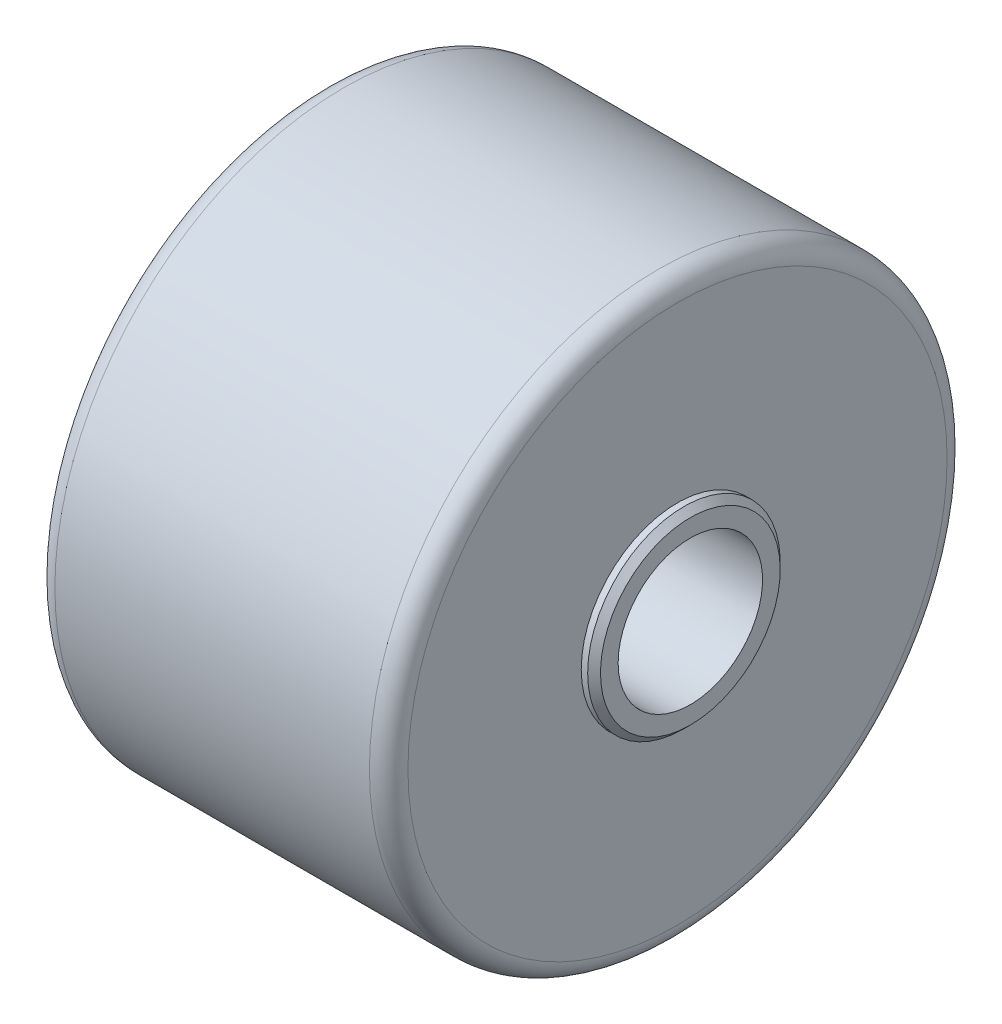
ISO-10303-21;
HEADER;
FILE_DESCRIPTION(('STEP AP214'),'2;1');
FILE_NAME('part.step','',(''),(''),'','','');
FILE_SCHEMA(('AUTOMOTIVE_DESIGN { 1 0 10303 214 1 1 1 1 }'));
ENDSEC;
DATA;
#1=APPLICATION_CONTEXT('core data for automotive mechanical design processes');
#2=APPLICATION_PROTOCOL_DEFINITION('international standard','automotive_design',2000,#1);
#3=PRODUCT_CONTEXT('',#1,'mechanical');
#4=PRODUCT('Part','Part','',(#3));
#5=PRODUCT_RELATED_PRODUCT_CATEGORY('part','',(#4));
#6=PRODUCT_DEFINITION_FORMATION('','',#4);
#7=PRODUCT_DEFINITION_CONTEXT('part definition',#1,'design');
#8=PRODUCT_DEFINITION('design','',#6,#7);
#9=PRODUCT_DEFINITION_SHAPE('','',#8);
#10=(LENGTH_UNIT() NAMED_UNIT(*) SI_UNIT(.MILLI.,.METRE.));
#11=(NAMED_UNIT(*) PLANE_ANGLE_UNIT() SI_UNIT($,.RADIAN.));
#12=(NAMED_UNIT(*) SI_UNIT($,.STERADIAN.) SOLID_ANGLE_UNIT());
#13=UNCERTAINTY_MEASURE_WITH_UNIT(LENGTH_MEASURE(1.E-05),#10,'distance_accuracy_value','');
#14=(GEOMETRIC_REPRESENTATION_CONTEXT(3) GLOBAL_UNCERTAINTY_ASSIGNED_CONTEXT((#13)) GLOBAL_UNIT_ASSIGNED_CONTEXT((#10,
#11,#12)) REPRESENTATION_CONTEXT('',''));
#15=CARTESIAN_POINT('',(0.,0.,0.));
#16=DIRECTION('',(0.,0.,1.));
#17=DIRECTION('',(1.,0.,0.));
#18=AXIS2_PLACEMENT_3D('',#15,#16,#17);
#19=CARTESIAN_POINT('',(50.,0.,0.));
#20=DIRECTION('',(-1.,0.,0.));
#21=DIRECTION('',(0.,0.,1.));
#22=AXIS2_PLACEMENT_3D('',#19,#20,#21);
#23=CYLINDRICAL_SURFACE('',#22,11.25);
#24=CARTESIAN_POINT('',(-29.5,0.,0.));
#25=DIRECTION('',(-1.,0.,0.));
#26=DIRECTION('',(0.,0.,1.));
#27=AXIS2_PLACEMENT_3D('',#24,#25,#26);
#28=CIRCLE('',#27,11.25);
#29=CARTESIAN_POINT('',(-29.5,0.,11.25));
#30=VERTEX_POINT('',#29);
#31=EDGE_CURVE('E17',#30,#30,#28,.F.);
#32=ORIENTED_EDGE('',*,*,#31,.F.);
#33=EDGE_LOOP('',(#32));
#34=FACE_BOUND('',#33,.T.);
#35=CARTESIAN_POINT('',(29.5,0.,0.));
#36=DIRECTION('',(-1.,0.,0.));
#37=DIRECTION('',(0.,0.,1.));
#38=AXIS2_PLACEMENT_3D('',#35,#36,#37);
#39=CIRCLE('',#38,11.25);
#40=CARTESIAN_POINT('',(29.5,0.,11.25));
#41=VERTEX_POINT('',#40);
#42=EDGE_CURVE('E139',#41,#41,#39,.T.);
#43=ORIENTED_EDGE('',*,*,#42,.F.);
#44=EDGE_LOOP('',(#43));
#45=FACE_BOUND('',#44,.T.);
#46=ADVANCED_FACE('F14',(#34,#45),#23,.F.);
#47=CARTESIAN_POINT('',(-29.5,14.,0.));
#48=DIRECTION('',(-1.,0.,0.));
#49=DIRECTION('',(0.,0.,1.));
#50=AXIS2_PLACEMENT_3D('',#47,#48,#49);
#51=PLANE('',#50);
#52=CARTESIAN_POINT('',(-29.5,0.,0.));
#53=DIRECTION('',(1.,0.,0.));
#54=DIRECTION('',(0.,1.,0.));
#55=AXIS2_PLACEMENT_3D('',#52,#53,#54);
#56=CIRCLE('',#55,14.);
#57=CARTESIAN_POINT('',(-29.5,14.,0.));
#58=VERTEX_POINT('',#57);
#59=EDGE_CURVE('E137',#58,#58,#56,.T.);
#60=ORIENTED_EDGE('',*,*,#59,.F.);
#61=EDGE_LOOP('',(#60));
#62=FACE_BOUND('',#61,.T.);
#63=ORIENTED_EDGE('',*,*,#31,.T.);
#64=EDGE_LOOP('',(#63));
#65=FACE_BOUND('',#64,.T.);
#66=ADVANCED_FACE('F99',(#62,#65),#51,.T.);
#67=CARTESIAN_POINT('',(29.5,11.25,0.));
#68=DIRECTION('',(1.,0.,0.));
#69=DIRECTION('',(0.,0.,-1.));
#70=AXIS2_PLACEMENT_3D('',#67,#68,#69);
#71=PLANE('',#70);
#72=ORIENTED_EDGE('',*,*,#42,.T.);
#73=EDGE_LOOP('',(#72));
#74=FACE_BOUND('',#73,.T.);
#75=CARTESIAN_POINT('',(29.5,0.,0.));
#76=DIRECTION('',(-1.,0.,0.));
#77=DIRECTION('',(0.,-1.,0.));
#78=AXIS2_PLACEMENT_3D('',#75,#76,#77);
#79=CIRCLE('',#78,14.);
#80=CARTESIAN_POINT('',(29.5,-14.,0.));
#81=VERTEX_POINT('',#80);
#82=EDGE_CURVE('E133',#81,#81,#79,.T.);
#83=ORIENTED_EDGE('',*,*,#82,.F.);
#84=EDGE_LOOP('',(#83));
#85=FACE_BOUND('',#84,.T.);
#86=ADVANCED_FACE('F96',(#74,#85),#71,.T.);
#87=CARTESIAN_POINT('',(-28.5,0.,0.));
#88=DIRECTION('',(1.,0.,0.));
#89=DIRECTION('',(0.,1.,0.));
#90=AXIS2_PLACEMENT_3D('',#87,#88,#89);
#91=CONICAL_SURFACE('',#90,15.,0.785398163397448);
#92=CARTESIAN_POINT('',(-28.5,0.,0.));
#93=DIRECTION('',(-1.,0.,0.));
#94=DIRECTION('',(0.,0.,1.));
#95=AXIS2_PLACEMENT_3D('',#92,#93,#94);
#96=CIRCLE('',#95,15.);
#97=CARTESIAN_POINT('',(-28.5,0.,15.));
#98=VERTEX_POINT('',#97);
#99=EDGE_CURVE('E136',#98,#98,#96,.F.);
#100=ORIENTED_EDGE('',*,*,#99,.F.);
#101=EDGE_LOOP('',(#100));
#102=FACE_BOUND('',#101,.T.);
#103=ORIENTED_EDGE('',*,*,#59,.T.);
#104=EDGE_LOOP('',(#103));
#105=FACE_BOUND('',#104,.T.);
#106=ADVANCED_FACE('F92',(#102,#105),#91,.T.);
#107=CARTESIAN_POINT('',(28.5,0.,0.));
#108=DIRECTION('',(-1.,0.,0.));
#109=DIRECTION('',(0.,-1.,0.));
#110=AXIS2_PLACEMENT_3D('',#107,#108,#109);
#111=CONICAL_SURFACE('',#110,15.,0.785398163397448);
#112=ORIENTED_EDGE('',*,*,#82,.T.);
#113=EDGE_LOOP('',(#112));
#114=FACE_BOUND('',#113,.T.);
#115=CARTESIAN_POINT('',(28.5,0.,0.));
#116=DIRECTION('',(-1.,0.,0.));
#117=DIRECTION('',(0.,0.,1.));
#118=AXIS2_PLACEMENT_3D('',#115,#116,#117);
#119=CIRCLE('',#118,15.);
#120=CARTESIAN_POINT('',(28.5,0.,15.));
#121=VERTEX_POINT('',#120);
#122=EDGE_CURVE('E127',#121,#121,#119,.T.);
#123=ORIENTED_EDGE('',*,*,#122,.F.);
#124=EDGE_LOOP('',(#123));
#125=FACE_BOUND('',#124,.T.);
#126=ADVANCED_FACE('F88',(#114,#125),#111,.T.);
#127=CARTESIAN_POINT('',(50.,0.,0.));
#128=DIRECTION('',(-1.,0.,0.));
#129=DIRECTION('',(0.,0.,1.));
#130=AXIS2_PLACEMENT_3D('',#127,#128,#129);
#131=CYLINDRICAL_SURFACE('',#130,15.);
#132=CARTESIAN_POINT('',(-27.5,0.,0.));
#133=DIRECTION('',(-1.,0.,0.));
#134=DIRECTION('',(0.,0.,1.));
#135=AXIS2_PLACEMENT_3D('',#132,#133,#134);
#136=CIRCLE('',#135,15.);
#137=CARTESIAN_POINT('',(-27.5,0.,15.));
#138=VERTEX_POINT('',#137);
#139=EDGE_CURVE('E122',#138,#138,#136,.F.);
#140=ORIENTED_EDGE('',*,*,#139,.F.);
#141=EDGE_LOOP('',(#140));
#142=FACE_BOUND('',#141,.T.);
#143=ORIENTED_EDGE('',*,*,#99,.T.);
#144=EDGE_LOOP('',(#143));
#145=FACE_BOUND('',#144,.T.);
#146=ADVANCED_FACE('F84',(#142,#145),#131,.T.);
#147=CARTESIAN_POINT('',(50.,0.,0.));
#148=DIRECTION('',(-1.,0.,0.));
#149=DIRECTION('',(0.,0.,1.));
#150=AXIS2_PLACEMENT_3D('',#147,#148,#149);
#151=CYLINDRICAL_SURFACE('',#150,15.);
#152=ORIENTED_EDGE('',*,*,#122,.T.);
#153=EDGE_LOOP('',(#152));
#154=FACE_BOUND('',#153,.T.);
#155=CARTESIAN_POINT('',(27.5,0.,0.));
#156=DIRECTION('',(-1.,0.,0.));
#157=DIRECTION('',(0.,0.,1.));
#158=AXIS2_PLACEMENT_3D('',#155,#156,#157);
#159=CIRCLE('',#158,15.);
#160=CARTESIAN_POINT('',(27.5,0.,15.));
#161=VERTEX_POINT('',#160);
#162=EDGE_CURVE('E120',#161,#161,#159,.T.);
#163=ORIENTED_EDGE('',*,*,#162,.F.);
#164=EDGE_LOOP('',(#163));
#165=FACE_BOUND('',#164,.T.);
#166=ADVANCED_FACE('F80',(#154,#165),#151,.T.);
#167=CARTESIAN_POINT('',(-27.5,42.,0.));
#168=DIRECTION('',(-1.,0.,0.));
#169=DIRECTION('',(0.,0.,1.));
#170=AXIS2_PLACEMENT_3D('',#167,#168,#169);
#171=PLANE('',#170);
#172=CARTESIAN_POINT('',(-27.5,0.,0.));
#173=DIRECTION('',(1.,0.,0.));
#174=DIRECTION('',(0.,0.,-1.));
#175=AXIS2_PLACEMENT_3D('',#172,#173,#174);
#176=CIRCLE('',#175,42.);
#177=CARTESIAN_POINT('',(-27.5,0.,-42.));
#178=VERTEX_POINT('',#177);
#179=EDGE_CURVE('E64',#178,#178,#176,.T.);
#180=ORIENTED_EDGE('',*,*,#179,.F.);
#181=EDGE_LOOP('',(#180));
#182=FACE_BOUND('',#181,.T.);
#183=ORIENTED_EDGE('',*,*,#139,.T.);
#184=EDGE_LOOP('',(#183));
#185=FACE_BOUND('',#184,.T.);
#186=ADVANCED_FACE('F70',(#182,#185),#171,.T.);
#187=CARTESIAN_POINT('',(27.5,15.,0.));
#188=DIRECTION('',(1.,0.,0.));
#189=DIRECTION('',(0.,0.,-1.));
#190=AXIS2_PLACEMENT_3D('',#187,#188,#189);
#191=PLANE('',#190);
#192=ORIENTED_EDGE('',*,*,#162,.T.);
#193=EDGE_LOOP('',(#192));
#194=FACE_BOUND('',#193,.T.);
#195=CARTESIAN_POINT('',(27.5,0.,0.));
#196=DIRECTION('',(-1.,0.,0.));
#197=DIRECTION('',(0.,0.,-1.));
#198=AXIS2_PLACEMENT_3D('',#195,#196,#197);
#199=CIRCLE('',#198,42.);
#200=CARTESIAN_POINT('',(27.5,1.76230435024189E-13,-42.));
#201=VERTEX_POINT('',#200);
#202=EDGE_CURVE('E26',#201,#201,#199,.T.);
#203=ORIENTED_EDGE('',*,*,#202,.F.);
#204=EDGE_LOOP('',(#203));
#205=FACE_BOUND('',#204,.T.);
#206=ADVANCED_FACE('F79',(#194,#205),#191,.T.);
#207=CARTESIAN_POINT('',(-24.5,0.,0.));
#208=DIRECTION('',(1.,0.,0.));
#209=DIRECTION('',(0.,0.,-1.));
#210=AXIS2_PLACEMENT_3D('',#207,#208,#209);
#211=TOROIDAL_SURFACE('',#210,42.,3.);
#212=CARTESIAN_POINT('',(-24.5,0.,0.));
#213=DIRECTION('',(-1.,0.,0.));
#214=DIRECTION('',(0.,0.,1.));
#215=AXIS2_PLACEMENT_3D('',#212,#213,#214);
#216=CIRCLE('',#215,45.);
#217=CARTESIAN_POINT('',(-24.5,0.,45.));
#218=VERTEX_POINT('',#217);
#219=EDGE_CURVE('E21',#218,#218,#216,.F.);
#220=ORIENTED_EDGE('',*,*,#219,.F.);
#221=EDGE_LOOP('',(#220));
#222=FACE_BOUND('',#221,.T.);
#223=ORIENTED_EDGE('',*,*,#179,.T.);
#224=EDGE_LOOP('',(#223));
#225=FACE_BOUND('',#224,.T.);
#226=ADVANCED_FACE('F44',(#222,#225),#211,.T.);
#227=CARTESIAN_POINT('',(24.5,0.,0.));
#228=DIRECTION('',(1.,0.,0.));
#229=DIRECTION('',(0.,0.,-1.));
#230=AXIS2_PLACEMENT_3D('',#227,#228,#229);
#231=TOROIDAL_SURFACE('',#230,42.,3.);
#232=ORIENTED_EDGE('',*,*,#202,.T.);
#233=EDGE_LOOP('',(#232));
#234=FACE_BOUND('',#233,.T.);
#235=CARTESIAN_POINT('',(24.5,0.,0.));
#236=DIRECTION('',(-1.,0.,0.));
#237=DIRECTION('',(0.,0.,1.));
#238=AXIS2_PLACEMENT_3D('',#235,#236,#237);
#239=CIRCLE('',#238,45.);
#240=CARTESIAN_POINT('',(24.5,0.,45.));
#241=VERTEX_POINT('',#240);
#242=EDGE_CURVE('E10',#241,#241,#239,.T.);
#243=ORIENTED_EDGE('',*,*,#242,.F.);
#244=EDGE_LOOP('',(#243));
#245=FACE_BOUND('',#244,.T.);
#246=ADVANCED_FACE('F38',(#234,#245),#231,.T.);
#247=CARTESIAN_POINT('',(50.,0.,0.));
#248=DIRECTION('',(-1.,0.,0.));
#249=DIRECTION('',(0.,0.,1.));
#250=AXIS2_PLACEMENT_3D('',#247,#248,#249);
#251=CYLINDRICAL_SURFACE('',#250,45.);
#252=ORIENTED_EDGE('',*,*,#242,.T.);
#253=EDGE_LOOP('',(#252));
#254=FACE_BOUND('',#253,.T.);
#255=ORIENTED_EDGE('',*,*,#219,.T.);
#256=EDGE_LOOP('',(#255));
#257=FACE_BOUND('',#256,.T.);
#258=ADVANCED_FACE('F43',(#254,#257),#251,.T.);
#259=CLOSED_SHELL('',(#46,#66,#86,#106,#126,#146,#166,#186,#206,#226,#246,#258));
#260=MANIFOLD_SOLID_BREP('B1',#259);
#261=ADVANCED_BREP_SHAPE_REPRESENTATION('',(#18,#260),#14);
#262=SHAPE_DEFINITION_REPRESENTATION(#9,#261);
ENDSEC;
END-ISO-10303-21;
